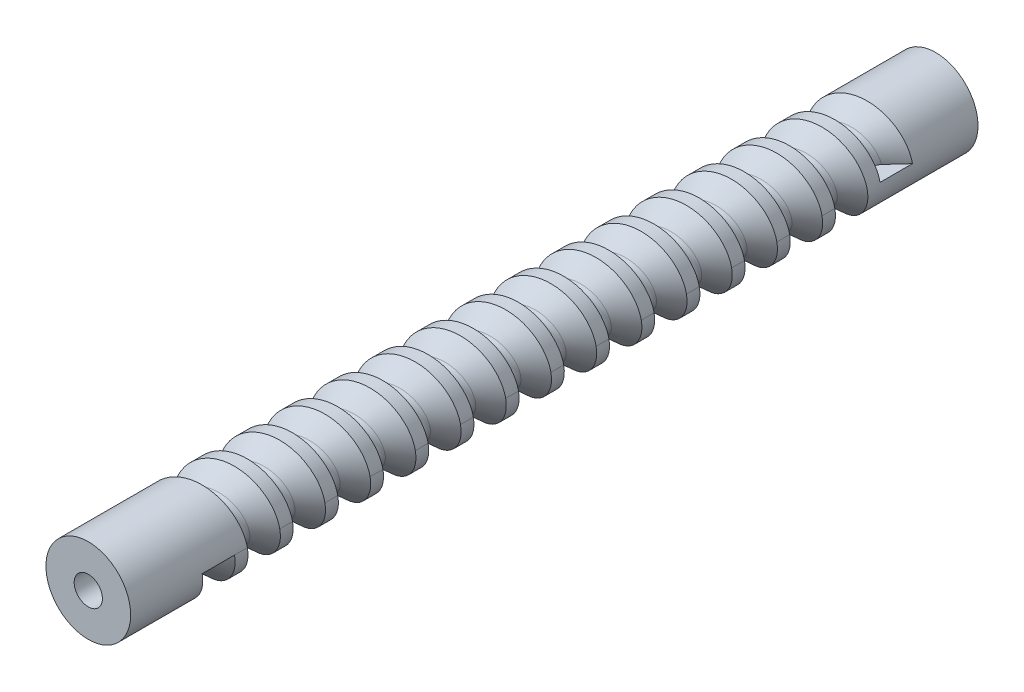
from build123d import *

# Parameters (mm, degrees)
SKETCH1_R              = 15
BOSS_EXTRUDE1_DEPTH    = 300
CUT_SWEEP1_PITCH       = 16
CUT_SWEEP1_HEIGHT      = 240
CUT_SWEEP1_RADIUS      = 15
CUT_SWEEP1_START_ANGLE = 180
SKETCH5_R              = 5
CUT_EXTRUDE2_DEPTH     = 10


with BuildPart() as part:
    # Sketch1 → Boss-Extrude1 (new body)
    with BuildSketch(Plane.XY):
        Circle(SKETCH1_R)
    extrude(amount=BOSS_EXTRUDE1_DEPTH)

    # Cut-Sweep1: sweep along a helix
    with BuildLine() as cut_sweep1_path:
        add(Helix(CUT_SWEEP1_PITCH, CUT_SWEEP1_HEIGHT, CUT_SWEEP1_RADIUS, center=(0, 0, 270), direction=(0, 0, -1), mode=Mode.PRIVATE).rotate(Axis((0, 0, 270), (0, 0, -1)), CUT_SWEEP1_START_ANGLE))
    # Sketch3 → Cut-Sweep1 (sweep, cut)
    with BuildSketch(Plane(origin=(0, 0, 0), x_dir=(0, 0, -1), z_dir=(1, 0, 0))):
        with BuildLine():
            Line((-257.07058543, -16.957580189), (-264.929868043, -9.788988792))
            ThreePointArc((-264.929868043, -9.788988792), (-267.860238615, -9.146393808), (-269.881927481, -11.362871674))
            Line((-269.881927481, -11.362871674), (-272.160468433, -21.75350577))
            Line((-272.160468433, -21.75350577), (-257.07058543, -16.957580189))
        make_face()
    sweep(path=cut_sweep1_path.line, is_frenet=True, mode=Mode.SUBTRACT)

    # Sketch5 → Cut-Extrude2 (cut)
    with BuildSketch(Plane.XY.offset(300)):
        Circle(SKETCH5_R)
    extrude(amount=-CUT_EXTRUDE2_DEPTH, mode=Mode.SUBTRACT)


solid = part.part
